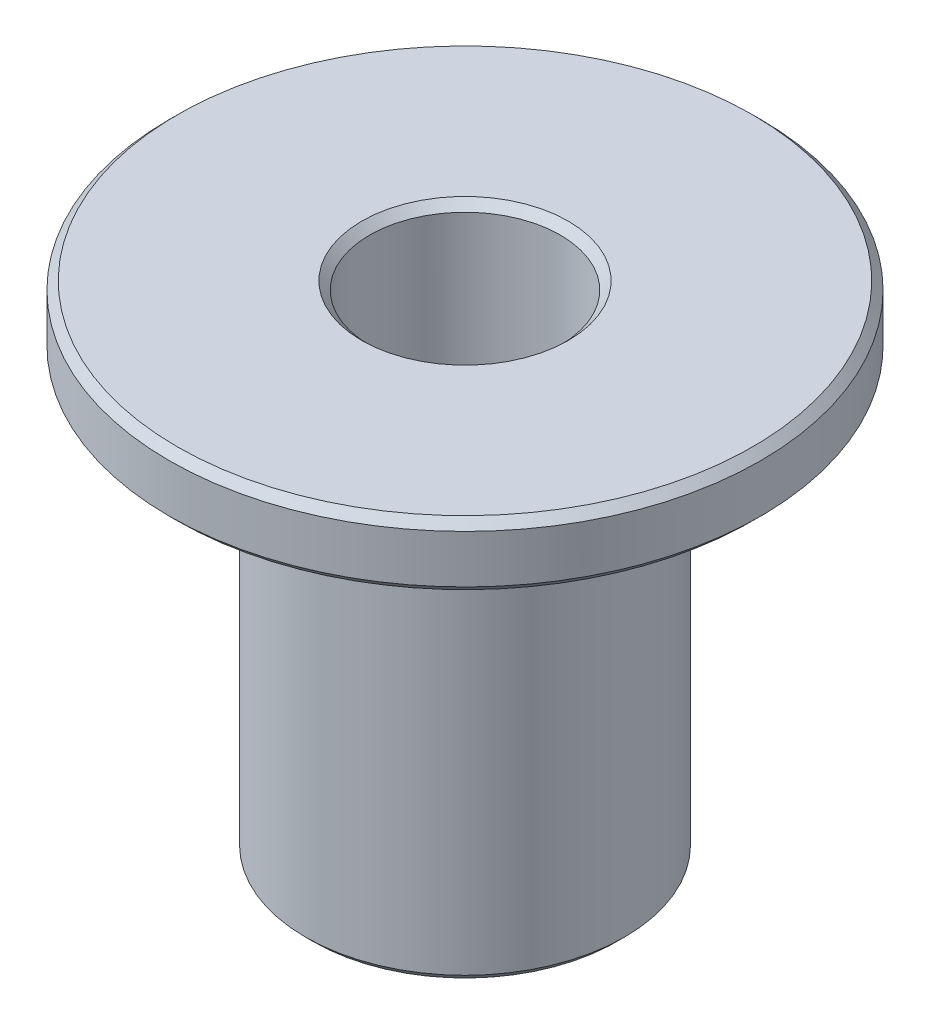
ISO-10303-21;
HEADER;
FILE_DESCRIPTION(('STEP AP214'),'2;1');
FILE_NAME('part.step','',(''),(''),'','','');
FILE_SCHEMA(('AUTOMOTIVE_DESIGN { 1 0 10303 214 1 1 1 1 }'));
ENDSEC;
DATA;
#1=APPLICATION_CONTEXT('core data for automotive mechanical design processes');
#2=APPLICATION_PROTOCOL_DEFINITION('international standard','automotive_design',2000,#1);
#3=PRODUCT_CONTEXT('',#1,'mechanical');
#4=PRODUCT('Part','Part','',(#3));
#5=PRODUCT_RELATED_PRODUCT_CATEGORY('part','',(#4));
#6=PRODUCT_DEFINITION_FORMATION('','',#4);
#7=PRODUCT_DEFINITION_CONTEXT('part definition',#1,'design');
#8=PRODUCT_DEFINITION('design','',#6,#7);
#9=PRODUCT_DEFINITION_SHAPE('','',#8);
#10=(LENGTH_UNIT() NAMED_UNIT(*) SI_UNIT(.MILLI.,.METRE.));
#11=(NAMED_UNIT(*) PLANE_ANGLE_UNIT() SI_UNIT($,.RADIAN.));
#12=(NAMED_UNIT(*) SI_UNIT($,.STERADIAN.) SOLID_ANGLE_UNIT());
#13=UNCERTAINTY_MEASURE_WITH_UNIT(LENGTH_MEASURE(1.E-05),#10,'distance_accuracy_value','');
#14=(GEOMETRIC_REPRESENTATION_CONTEXT(3) GLOBAL_UNCERTAINTY_ASSIGNED_CONTEXT((#13)) GLOBAL_UNIT_ASSIGNED_CONTEXT((#10,
#11,#12)) REPRESENTATION_CONTEXT('',''));
#15=CARTESIAN_POINT('',(0.,0.,0.));
#16=DIRECTION('',(0.,0.,1.));
#17=DIRECTION('',(1.,0.,0.));
#18=AXIS2_PLACEMENT_3D('',#15,#16,#17);
#19=CARTESIAN_POINT('',(4.975,14.5,0.));
#20=DIRECTION('',(0.,1.,0.));
#21=DIRECTION('',(0.,0.,1.));
#22=AXIS2_PLACEMENT_3D('',#19,#20,#21);
#23=PLANE('',#22);
#24=CARTESIAN_POINT('',(0.,14.5,0.));
#25=DIRECTION('',(0.,1.,0.));
#26=DIRECTION('',(0.,0.,1.));
#27=AXIS2_PLACEMENT_3D('',#24,#25,#26);
#28=CIRCLE('',#27,3.225);
#29=CARTESIAN_POINT('',(0.,14.5,3.225));
#30=VERTEX_POINT('',#29);
#31=EDGE_CURVE('E63',#30,#30,#28,.T.);
#32=ORIENTED_EDGE('',*,*,#31,.T.);
#33=EDGE_LOOP('',(#32));
#34=FACE_BOUND('',#33,.T.);
#35=CARTESIAN_POINT('',(0.,14.5,0.));
#36=DIRECTION('',(0.,1.,0.));
#37=DIRECTION('',(0.,0.,1.));
#38=AXIS2_PLACEMENT_3D('',#35,#36,#37);
#39=CIRCLE('',#38,4.725);
#40=CARTESIAN_POINT('',(0.,14.5,4.725));
#41=VERTEX_POINT('',#40);
#42=EDGE_CURVE('E66',#41,#41,#39,.F.);
#43=ORIENTED_EDGE('',*,*,#42,.T.);
#44=EDGE_LOOP('',(#43));
#45=FACE_BOUND('',#44,.T.);
#46=ADVANCED_FACE('F32',(#34,#45),#23,.F.);
#47=CARTESIAN_POINT('',(0.,30.,0.));
#48=DIRECTION('',(0.,1.,0.));
#49=DIRECTION('',(0.,0.,1.));
#50=AXIS2_PLACEMENT_3D('',#47,#48,#49);
#51=CYLINDRICAL_SURFACE('',#50,2.975);
#52=CARTESIAN_POINT('',(0.,14.75,0.));
#53=DIRECTION('',(0.,1.,0.));
#54=DIRECTION('',(0.,0.,1.));
#55=AXIS2_PLACEMENT_3D('',#52,#53,#54);
#56=CIRCLE('',#55,2.975);
#57=CARTESIAN_POINT('',(0.,14.75,2.975));
#58=VERTEX_POINT('',#57);
#59=EDGE_CURVE('E57',#58,#58,#56,.F.);
#60=ORIENTED_EDGE('',*,*,#59,.T.);
#61=EDGE_LOOP('',(#60));
#62=FACE_BOUND('',#61,.T.);
#63=CARTESIAN_POINT('',(0.,29.75,0.));
#64=DIRECTION('',(0.,-1.,0.));
#65=DIRECTION('',(0.,0.,-1.));
#66=AXIS2_PLACEMENT_3D('',#63,#64,#65);
#67=CIRCLE('',#66,2.975);
#68=CARTESIAN_POINT('',(0.,29.75,-2.975));
#69=VERTEX_POINT('',#68);
#70=EDGE_CURVE('E60',#69,#69,#67,.F.);
#71=ORIENTED_EDGE('',*,*,#70,.T.);
#72=EDGE_LOOP('',(#71));
#73=FACE_BOUND('',#72,.T.);
#74=ADVANCED_FACE('F89',(#62,#73),#51,.F.);
#75=CARTESIAN_POINT('',(2.975,30.,0.));
#76=DIRECTION('',(0.,-1.,0.));
#77=DIRECTION('',(0.,0.,-1.));
#78=AXIS2_PLACEMENT_3D('',#75,#76,#77);
#79=PLANE('',#78);
#80=CARTESIAN_POINT('',(0.,30.,0.));
#81=DIRECTION('',(0.,-1.,0.));
#82=DIRECTION('',(0.,0.,-1.));
#83=AXIS2_PLACEMENT_3D('',#80,#81,#82);
#84=CIRCLE('',#83,3.225);
#85=CARTESIAN_POINT('',(0.,30.,-3.225));
#86=VERTEX_POINT('',#85);
#87=EDGE_CURVE('E51',#86,#86,#84,.T.);
#88=ORIENTED_EDGE('',*,*,#87,.T.);
#89=EDGE_LOOP('',(#88));
#90=FACE_BOUND('',#89,.T.);
#91=CARTESIAN_POINT('',(0.,30.,0.));
#92=DIRECTION('',(0.,-1.,0.));
#93=DIRECTION('',(0.,0.,-1.));
#94=AXIS2_PLACEMENT_3D('',#91,#92,#93);
#95=CIRCLE('',#94,8.975);
#96=CARTESIAN_POINT('',(0.,30.,-8.975));
#97=VERTEX_POINT('',#96);
#98=EDGE_CURVE('E54',#97,#97,#95,.F.);
#99=ORIENTED_EDGE('',*,*,#98,.T.);
#100=EDGE_LOOP('',(#99));
#101=FACE_BOUND('',#100,.T.);
#102=ADVANCED_FACE('F94',(#90,#101),#79,.F.);
#103=CARTESIAN_POINT('',(0.,30.,0.));
#104=DIRECTION('',(0.,1.,0.));
#105=DIRECTION('',(0.,0.,1.));
#106=AXIS2_PLACEMENT_3D('',#103,#104,#105);
#107=CYLINDRICAL_SURFACE('',#106,9.225);
#108=CARTESIAN_POINT('',(0.,29.75,0.));
#109=DIRECTION('',(0.,-1.,0.));
#110=DIRECTION('',(0.,0.,-1.));
#111=AXIS2_PLACEMENT_3D('',#108,#109,#110);
#112=CIRCLE('',#111,9.225);
#113=CARTESIAN_POINT('',(0.,29.75,-9.225));
#114=VERTEX_POINT('',#113);
#115=EDGE_CURVE('E42',#114,#114,#112,.T.);
#116=ORIENTED_EDGE('',*,*,#115,.T.);
#117=EDGE_LOOP('',(#116));
#118=FACE_BOUND('',#117,.T.);
#119=CARTESIAN_POINT('',(0.,28.25,0.));
#120=DIRECTION('',(0.,1.,0.));
#121=DIRECTION('',(0.,0.,1.));
#122=AXIS2_PLACEMENT_3D('',#119,#120,#121);
#123=CIRCLE('',#122,9.225);
#124=CARTESIAN_POINT('',(0.,28.25,9.225));
#125=VERTEX_POINT('',#124);
#126=EDGE_CURVE('E46',#125,#125,#123,.T.);
#127=ORIENTED_EDGE('',*,*,#126,.T.);
#128=EDGE_LOOP('',(#127));
#129=FACE_BOUND('',#128,.T.);
#130=ADVANCED_FACE('F86',(#118,#129),#107,.T.);
#131=CARTESIAN_POINT('',(9.225,28.,0.));
#132=DIRECTION('',(0.,1.,0.));
#133=DIRECTION('',(0.,0.,1.));
#134=AXIS2_PLACEMENT_3D('',#131,#132,#133);
#135=PLANE('',#134);
#136=CARTESIAN_POINT('',(0.,28.,0.));
#137=DIRECTION('',(0.,1.,0.));
#138=DIRECTION('',(0.,0.,1.));
#139=AXIS2_PLACEMENT_3D('',#136,#137,#138);
#140=CIRCLE('',#139,8.975);
#141=CARTESIAN_POINT('',(0.,28.,8.975));
#142=VERTEX_POINT('',#141);
#143=EDGE_CURVE('E38',#142,#142,#140,.F.);
#144=ORIENTED_EDGE('',*,*,#143,.T.);
#145=EDGE_LOOP('',(#144));
#146=FACE_BOUND('',#145,.T.);
#147=CARTESIAN_POINT('',(0.,28.,0.));
#148=DIRECTION('',(0.,1.,0.));
#149=DIRECTION('',(0.,0.,1.));
#150=AXIS2_PLACEMENT_3D('',#147,#148,#149);
#151=CIRCLE('',#150,4.975);
#152=CARTESIAN_POINT('',(0.,28.,4.975));
#153=VERTEX_POINT('',#152);
#154=EDGE_CURVE('E69',#153,#153,#151,.T.);
#155=ORIENTED_EDGE('',*,*,#154,.T.);
#156=EDGE_LOOP('',(#155));
#157=FACE_BOUND('',#156,.T.);
#158=ADVANCED_FACE('F73',(#146,#157),#135,.F.);
#159=CARTESIAN_POINT('',(0.,30.,0.));
#160=DIRECTION('',(0.,1.,0.));
#161=DIRECTION('',(0.,0.,1.));
#162=AXIS2_PLACEMENT_3D('',#159,#160,#161);
#163=CYLINDRICAL_SURFACE('',#162,4.975);
#164=CARTESIAN_POINT('',(0.,14.75,0.));
#165=DIRECTION('',(0.,1.,0.));
#166=DIRECTION('',(0.,0.,1.));
#167=AXIS2_PLACEMENT_3D('',#164,#165,#166);
#168=CIRCLE('',#167,4.975);
#169=CARTESIAN_POINT('',(0.,14.75,4.975));
#170=VERTEX_POINT('',#169);
#171=EDGE_CURVE('E10',#170,#170,#168,.T.);
#172=ORIENTED_EDGE('',*,*,#171,.T.);
#173=EDGE_LOOP('',(#172));
#174=FACE_BOUND('',#173,.T.);
#175=ORIENTED_EDGE('',*,*,#154,.F.);
#176=EDGE_LOOP('',(#175));
#177=FACE_BOUND('',#176,.T.);
#178=ADVANCED_FACE('F75',(#174,#177),#163,.T.);
#179=CARTESIAN_POINT('',(0.,14.5,0.));
#180=DIRECTION('',(0.,-1.,0.));
#181=DIRECTION('',(0.,0.,-1.));
#182=AXIS2_PLACEMENT_3D('',#179,#180,#181);
#183=CONICAL_SURFACE('',#182,3.225,0.785398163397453);
#184=ORIENTED_EDGE('',*,*,#59,.F.);
#185=EDGE_LOOP('',(#184));
#186=FACE_BOUND('',#185,.T.);
#187=ORIENTED_EDGE('',*,*,#31,.F.);
#188=EDGE_LOOP('',(#187));
#189=FACE_BOUND('',#188,.T.);
#190=ADVANCED_FACE('F77',(#186,#189),#183,.F.);
#191=CARTESIAN_POINT('',(0.,29.75,0.));
#192=DIRECTION('',(0.,1.,0.));
#193=DIRECTION('',(0.,0.,1.));
#194=AXIS2_PLACEMENT_3D('',#191,#192,#193);
#195=CONICAL_SURFACE('',#194,2.975,0.785398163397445);
#196=ORIENTED_EDGE('',*,*,#87,.F.);
#197=EDGE_LOOP('',(#196));
#198=FACE_BOUND('',#197,.T.);
#199=ORIENTED_EDGE('',*,*,#70,.F.);
#200=EDGE_LOOP('',(#199));
#201=FACE_BOUND('',#200,.T.);
#202=ADVANCED_FACE('F83',(#198,#201),#195,.F.);
#203=CARTESIAN_POINT('',(0.,30.,0.));
#204=DIRECTION('',(0.,-1.,0.));
#205=DIRECTION('',(0.,0.,-1.));
#206=AXIS2_PLACEMENT_3D('',#203,#204,#205);
#207=CONICAL_SURFACE('',#206,8.975,0.785398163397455);
#208=ORIENTED_EDGE('',*,*,#115,.F.);
#209=EDGE_LOOP('',(#208));
#210=FACE_BOUND('',#209,.T.);
#211=ORIENTED_EDGE('',*,*,#98,.F.);
#212=EDGE_LOOP('',(#211));
#213=FACE_BOUND('',#212,.T.);
#214=ADVANCED_FACE('F108',(#210,#213),#207,.T.);
#215=CARTESIAN_POINT('',(0.,28.25,0.));
#216=DIRECTION('',(0.,1.,0.));
#217=DIRECTION('',(0.,0.,1.));
#218=AXIS2_PLACEMENT_3D('',#215,#216,#217);
#219=CONICAL_SURFACE('',#218,9.225,0.785398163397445);
#220=ORIENTED_EDGE('',*,*,#143,.F.);
#221=EDGE_LOOP('',(#220));
#222=FACE_BOUND('',#221,.T.);
#223=ORIENTED_EDGE('',*,*,#126,.F.);
#224=EDGE_LOOP('',(#223));
#225=FACE_BOUND('',#224,.T.);
#226=ADVANCED_FACE('F103',(#222,#225),#219,.T.);
#227=CARTESIAN_POINT('',(0.,14.75,0.));
#228=DIRECTION('',(0.,1.,0.));
#229=DIRECTION('',(0.,0.,1.));
#230=AXIS2_PLACEMENT_3D('',#227,#228,#229);
#231=CONICAL_SURFACE('',#230,4.975,0.785398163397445);
#232=ORIENTED_EDGE('',*,*,#42,.F.);
#233=EDGE_LOOP('',(#232));
#234=FACE_BOUND('',#233,.T.);
#235=ORIENTED_EDGE('',*,*,#171,.F.);
#236=EDGE_LOOP('',(#235));
#237=FACE_BOUND('',#236,.T.);
#238=ADVANCED_FACE('F100',(#234,#237),#231,.T.);
#239=CLOSED_SHELL('',(#46,#74,#102,#130,#158,#178,#190,#202,#214,#226,#238));
#240=MANIFOLD_SOLID_BREP('B2',#239);
#241=ADVANCED_BREP_SHAPE_REPRESENTATION('',(#18,#240),#14);
#242=SHAPE_DEFINITION_REPRESENTATION(#9,#241);
ENDSEC;
END-ISO-10303-21;
